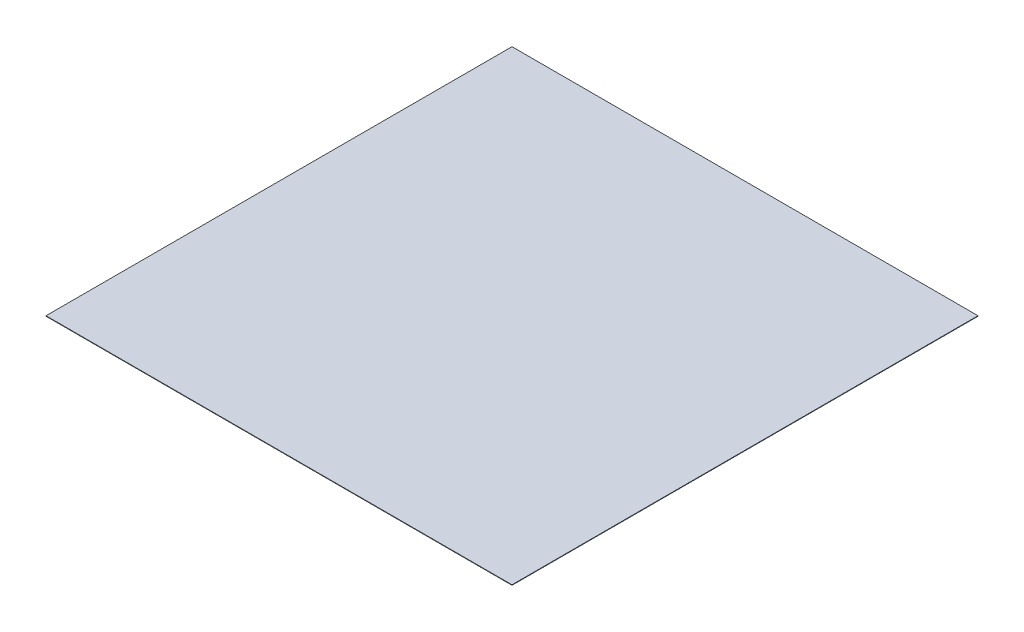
ISO-10303-21;
HEADER;
FILE_DESCRIPTION(('STEP AP214'),'2;1');
FILE_NAME('part.step','',(''),(''),'','','');
FILE_SCHEMA(('AUTOMOTIVE_DESIGN { 1 0 10303 214 1 1 1 1 }'));
ENDSEC;
DATA;
#1=APPLICATION_CONTEXT('core data for automotive mechanical design processes');
#2=APPLICATION_PROTOCOL_DEFINITION('international standard','automotive_design',2000,#1);
#3=PRODUCT_CONTEXT('',#1,'mechanical');
#4=PRODUCT('Part','Part','',(#3));
#5=PRODUCT_RELATED_PRODUCT_CATEGORY('part','',(#4));
#6=PRODUCT_DEFINITION_FORMATION('','',#4);
#7=PRODUCT_DEFINITION_CONTEXT('part definition',#1,'design');
#8=PRODUCT_DEFINITION('design','',#6,#7);
#9=PRODUCT_DEFINITION_SHAPE('','',#8);
#10=(LENGTH_UNIT() NAMED_UNIT(*) SI_UNIT(.MILLI.,.METRE.));
#11=(NAMED_UNIT(*) PLANE_ANGLE_UNIT() SI_UNIT($,.RADIAN.));
#12=(NAMED_UNIT(*) SI_UNIT($,.STERADIAN.) SOLID_ANGLE_UNIT());
#13=UNCERTAINTY_MEASURE_WITH_UNIT(LENGTH_MEASURE(1.E-05),#10,'distance_accuracy_value','');
#14=(GEOMETRIC_REPRESENTATION_CONTEXT(3) GLOBAL_UNCERTAINTY_ASSIGNED_CONTEXT((#13)) GLOBAL_UNIT_ASSIGNED_CONTEXT((#10,
#11,#12)) REPRESENTATION_CONTEXT('',''));
#15=CARTESIAN_POINT('',(0.,0.,0.));
#16=DIRECTION('',(0.,0.,1.));
#17=DIRECTION('',(1.,0.,0.));
#18=AXIS2_PLACEMENT_3D('',#15,#16,#17);
#19=CARTESIAN_POINT('',(-71.2223073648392,25.4,-25339.258989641));
#20=DIRECTION('',(1.,0.,0.));
#21=DIRECTION('',(0.,0.,-1.));
#22=AXIS2_PLACEMENT_3D('',#19,#20,#21);
#23=PLANE('',#22);
#24=DIRECTION('',(0.,0.,1.));
#25=VECTOR('',#24,1.);
#26=CARTESIAN_POINT('',(-71.2223073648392,0.,-25339.258989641));
#27=LINE('',#26,#25);
#28=CARTESIAN_POINT('',(-71.2223073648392,0.,-25339.258989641));
#29=VERTEX_POINT('',#28);
#30=CARTESIAN_POINT('',(-71.2223073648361,0.,60.741010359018));
#31=VERTEX_POINT('',#30);
#32=EDGE_CURVE('E84',#29,#31,#27,.T.);
#33=ORIENTED_EDGE('',*,*,#32,.T.);
#34=DIRECTION('',(0.,-1.,0.));
#35=VECTOR('',#34,1.);
#36=CARTESIAN_POINT('',(-71.2223073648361,25.4,60.741010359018));
#37=LINE('',#36,#35);
#38=CARTESIAN_POINT('',(-71.2223073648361,25.4,60.741010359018));
#39=VERTEX_POINT('',#38);
#40=EDGE_CURVE('E11',#39,#31,#37,.T.);
#41=ORIENTED_EDGE('',*,*,#40,.F.);
#42=DIRECTION('',(0.,0.,1.));
#43=VECTOR('',#42,1.);
#44=CARTESIAN_POINT('',(-71.2223073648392,25.4,-25339.258989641));
#45=LINE('',#44,#43);
#46=CARTESIAN_POINT('',(-71.2223073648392,25.4,-25339.258989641));
#47=VERTEX_POINT('',#46);
#48=EDGE_CURVE('E103',#47,#39,#45,.T.);
#49=ORIENTED_EDGE('',*,*,#48,.F.);
#50=DIRECTION('',(0.,-1.,0.));
#51=VECTOR('',#50,1.);
#52=CARTESIAN_POINT('',(-71.2223073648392,25.4,-25339.258989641));
#53=LINE('',#52,#51);
#54=EDGE_CURVE('E96',#47,#29,#53,.T.);
#55=ORIENTED_EDGE('',*,*,#54,.T.);
#56=EDGE_LOOP('',(#33,#41,#49,#55));
#57=FACE_BOUND('',#56,.T.);
#58=ADVANCED_FACE('F40',(#57),#23,.F.);
#59=CARTESIAN_POINT('',(-71.2223073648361,25.4,60.741010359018));
#60=DIRECTION('',(0.,0.,-1.));
#61=DIRECTION('',(-1.,0.,0.));
#62=AXIS2_PLACEMENT_3D('',#59,#60,#61);
#63=PLANE('',#62);
#64=DIRECTION('',(1.,0.,0.));
#65=VECTOR('',#64,1.);
#66=CARTESIAN_POINT('',(-71.2223073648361,0.,60.741010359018));
#67=LINE('',#66,#65);
#68=CARTESIAN_POINT('',(25328.7776926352,0.,60.741010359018));
#69=VERTEX_POINT('',#68);
#70=EDGE_CURVE('E80',#31,#69,#67,.T.);
#71=ORIENTED_EDGE('',*,*,#70,.T.);
#72=DIRECTION('',(0.,-1.,0.));
#73=VECTOR('',#72,1.);
#74=CARTESIAN_POINT('',(25328.7776926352,25.4,60.741010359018));
#75=LINE('',#74,#73);
#76=CARTESIAN_POINT('',(25328.7776926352,25.4,60.741010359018));
#77=VERTEX_POINT('',#76);
#78=EDGE_CURVE('E47',#77,#69,#75,.T.);
#79=ORIENTED_EDGE('',*,*,#78,.F.);
#80=DIRECTION('',(1.,0.,0.));
#81=VECTOR('',#80,1.);
#82=CARTESIAN_POINT('',(-71.2223073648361,25.4,60.741010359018));
#83=LINE('',#82,#81);
#84=EDGE_CURVE('E92',#39,#77,#83,.T.);
#85=ORIENTED_EDGE('',*,*,#84,.F.);
#86=ORIENTED_EDGE('',*,*,#40,.T.);
#87=EDGE_LOOP('',(#71,#79,#85,#86));
#88=FACE_BOUND('',#87,.T.);
#89=ADVANCED_FACE('F91',(#88),#63,.F.);
#90=CARTESIAN_POINT('',(25328.7776926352,25.4,-25339.258989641));
#91=DIRECTION('',(-1.,0.,0.));
#92=DIRECTION('',(0.,0.,1.));
#93=AXIS2_PLACEMENT_3D('',#90,#91,#92);
#94=PLANE('',#93);
#95=DIRECTION('',(0.,0.,-1.));
#96=VECTOR('',#95,1.);
#97=CARTESIAN_POINT('',(25328.7776926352,0.,-25339.258989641));
#98=LINE('',#97,#96);
#99=CARTESIAN_POINT('',(25328.7776926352,0.,-25339.258989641));
#100=VERTEX_POINT('',#99);
#101=EDGE_CURVE('E85',#69,#100,#98,.T.);
#102=ORIENTED_EDGE('',*,*,#101,.T.);
#103=DIRECTION('',(0.,-1.,0.));
#104=VECTOR('',#103,1.);
#105=CARTESIAN_POINT('',(25328.7776926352,25.4,-25339.258989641));
#106=LINE('',#105,#104);
#107=CARTESIAN_POINT('',(25328.7776926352,25.4,-25339.258989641));
#108=VERTEX_POINT('',#107);
#109=EDGE_CURVE('E110',#108,#100,#106,.T.);
#110=ORIENTED_EDGE('',*,*,#109,.F.);
#111=DIRECTION('',(0.,0.,-1.));
#112=VECTOR('',#111,1.);
#113=CARTESIAN_POINT('',(25328.7776926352,25.4,-25339.258989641));
#114=LINE('',#113,#112);
#115=EDGE_CURVE('E59',#77,#108,#114,.T.);
#116=ORIENTED_EDGE('',*,*,#115,.F.);
#117=ORIENTED_EDGE('',*,*,#78,.T.);
#118=EDGE_LOOP('',(#102,#110,#116,#117));
#119=FACE_BOUND('',#118,.T.);
#120=ADVANCED_FACE('F113',(#119),#94,.F.);
#121=CARTESIAN_POINT('',(-71.2223073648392,25.4,-25339.258989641));
#122=DIRECTION('',(0.,0.,1.));
#123=DIRECTION('',(1.,0.,0.));
#124=AXIS2_PLACEMENT_3D('',#121,#122,#123);
#125=PLANE('',#124);
#126=DIRECTION('',(-1.,0.,0.));
#127=VECTOR('',#126,1.);
#128=CARTESIAN_POINT('',(-71.2223073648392,0.,-25339.258989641));
#129=LINE('',#128,#127);
#130=EDGE_CURVE('E101',#100,#29,#129,.T.);
#131=ORIENTED_EDGE('',*,*,#130,.T.);
#132=ORIENTED_EDGE('',*,*,#54,.F.);
#133=DIRECTION('',(-1.,0.,0.));
#134=VECTOR('',#133,1.);
#135=CARTESIAN_POINT('',(-71.2223073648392,25.4,-25339.258989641));
#136=LINE('',#135,#134);
#137=EDGE_CURVE('E54',#108,#47,#136,.T.);
#138=ORIENTED_EDGE('',*,*,#137,.F.);
#139=ORIENTED_EDGE('',*,*,#109,.T.);
#140=EDGE_LOOP('',(#131,#132,#138,#139));
#141=FACE_BOUND('',#140,.T.);
#142=ADVANCED_FACE('F115',(#141),#125,.F.);
#143=CARTESIAN_POINT('',(-71.2223073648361,25.4,60.741010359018));
#144=DIRECTION('',(0.,1.,0.));
#145=DIRECTION('',(0.,0.,1.));
#146=AXIS2_PLACEMENT_3D('',#143,#144,#145);
#147=PLANE('',#146);
#148=ORIENTED_EDGE('',*,*,#48,.T.);
#149=ORIENTED_EDGE('',*,*,#84,.T.);
#150=ORIENTED_EDGE('',*,*,#115,.T.);
#151=ORIENTED_EDGE('',*,*,#137,.T.);
#152=EDGE_LOOP('',(#148,#149,#150,#151));
#153=FACE_BOUND('',#152,.T.);
#154=ADVANCED_FACE('F116',(#153),#147,.T.);
#155=CARTESIAN_POINT('',(-71.2223073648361,0.,60.741010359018));
#156=DIRECTION('',(0.,1.,0.));
#157=DIRECTION('',(0.,0.,1.));
#158=AXIS2_PLACEMENT_3D('',#155,#156,#157);
#159=PLANE('',#158);
#160=ORIENTED_EDGE('',*,*,#32,.F.);
#161=ORIENTED_EDGE('',*,*,#130,.F.);
#162=ORIENTED_EDGE('',*,*,#101,.F.);
#163=ORIENTED_EDGE('',*,*,#70,.F.);
#164=EDGE_LOOP('',(#160,#161,#162,#163));
#165=FACE_BOUND('',#164,.T.);
#166=ADVANCED_FACE('F81',(#165),#159,.F.);
#167=CLOSED_SHELL('',(#58,#89,#120,#142,#154,#166));
#168=MANIFOLD_SOLID_BREP('B2',#167);
#169=ADVANCED_BREP_SHAPE_REPRESENTATION('',(#18,#168),#14);
#170=SHAPE_DEFINITION_REPRESENTATION(#9,#169);
ENDSEC;
END-ISO-10303-21;
